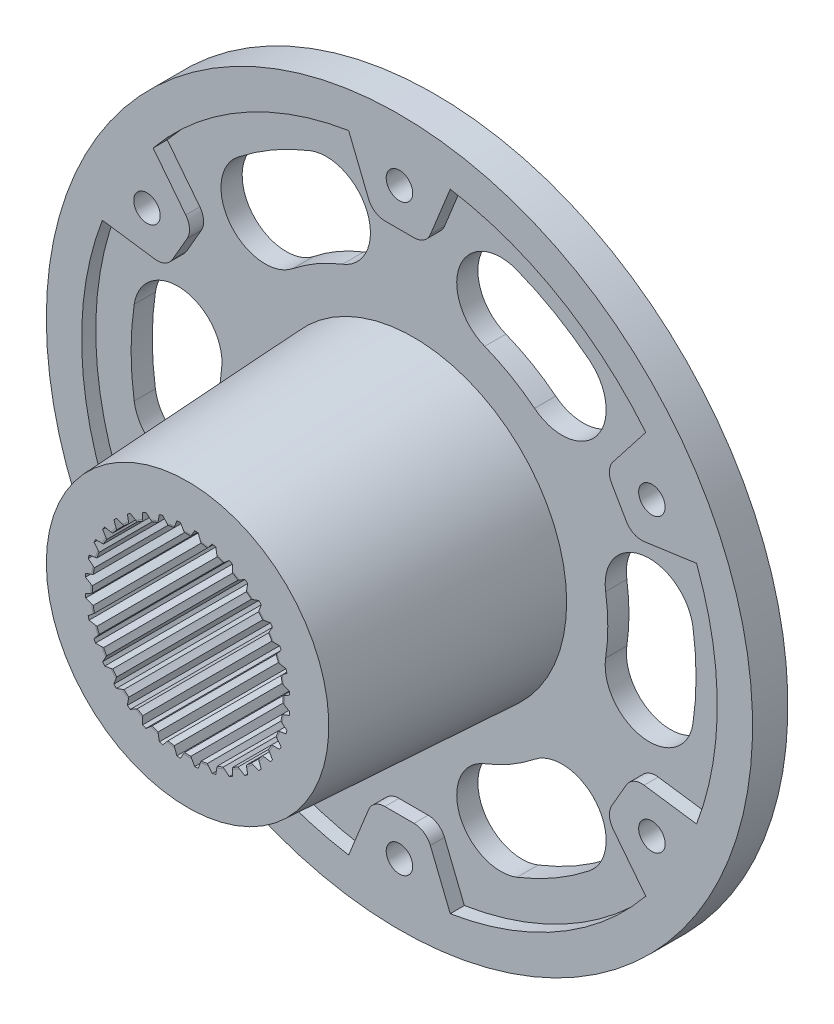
from build123d import *

# Parameters (mm, degrees)
BOSS_EXTRUDE1_REACH = 213.774
BOSS_EXTRUDE1_START = -70
SKETCH2_R           = 40
BOSS_EXTRUDE1_DRAFT = -3
BOSS_EXTRUDE3_REACH = 155.623
SKETCH5_R           = 3.75
CUT_EXTRUDE1_DEPTH  = 154.622914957
CIRPATTERN2_COUNT   = 6
CUT_EXTRUDE2_DEPTH  = 156.228863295
CIRPATTERN3_COUNT   = 6
SKETCH3_R           = 25.5
CUT_EXTRUDE11_DEPTH = 165.715659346
CUT_EXTRUDE11_DRAFT = -3
FILLET2_R           = 2
SKETCH41_R          = 27
CUT_EXTRUDE21_DEPTH = 158.797338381
CUT_EXTRUDE3_DEPTH  = 158.797338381
CIRPATTERN1_COUNT   = 36


with BuildPart() as part:
    # Sketch1 → Revolve1 (revolve)
    with BuildSketch(Plane(origin=(0, 0, 0), x_dir=(0, 0, -1), z_dir=(1, 0, 0)), mode=Mode.PRIVATE) as revolve1_sk:
        Polygon((0, 0), (0, 100), (-10, 100), (-10, 90), (-6, 90), (-6, 0), align=None)
    revolve(revolve1_sk.sketch.rotate(Axis((0, 0, 0), (0, 0, 1)), 90), axis=Axis((0, 0, 0), (0, 0, 1)))




with BuildPart() as boss_extrude1_long_prism_1:
    # Sketch2 → Boss-Extrude1 (the long prism of profile 1, to be tilted and cut off)
    with BuildSketch(Plane(origin=(0, 0, 0), x_dir=(-1, 0, 0), z_dir=(0, 0, -1)).offset(BOSS_EXTRUDE1_START)):
        Circle(SKETCH2_R)
    extrude(amount=BOSS_EXTRUDE1_REACH)
    boss_extrude1_tool1_sides = [boss_extrude1_long_prism_1.faces().sort_by_distance(p)[0] for p in [
        (40, 0, -36.887),
    ]]
    draft(boss_extrude1_tool1_sides, Plane(origin=(0, 0, 0), x_dir=(-1, 0, 0), z_dir=(0, 0, -1)).offset(BOSS_EXTRUDE1_START), BOSS_EXTRUDE1_DRAFT)  # the draft: side faces tilted about the start plane


with BuildPart() as part_1:
    add(part.part)
    boss_extrude1_tool1 = boss_extrude1_long_prism_1.part - part.part
    add(boss_extrude1_tool1.solids().sort_by_distance((0, 0, 70))[0])

    # Sketch4 → Boss-Extrude3 (add, up to next)
    with BuildSketch(Plane.XY.offset(10), mode=Mode.PRIVATE) as boss_extrude3_sk1:
        with BuildLine():
            Line((-14.38247559, 88.843370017), (-8.763376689, 74.935612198))
            ThreePointArc((-8.763376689, 74.935612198), (-6.923421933, 72.663457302), (-4.127457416, 71.808645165))
            Line((-4.127457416, 71.808645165), (4.127457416, 71.808645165))
            ThreePointArc((4.127457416, 71.808645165), (6.923421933, 72.663457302), (8.763376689, 74.935612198))
            Line((8.763376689, 74.935612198), (14.38247559, 88.843370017))
            ThreePointArc((14.38247559, 88.843370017), (0, 90), (-14.38247559, 88.843370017))
        make_face()
    boss_extrude3_tool1 = extrude(boss_extrude3_sk1.sketch, amount=-BOSS_EXTRUDE3_REACH, mode=Mode.PRIVATE) - part_1.part
    boss_extrude3 = boss_extrude3_tool1.solids().sort_by_distance((0, 81.769137, 10))[0]
    add(boss_extrude3)

    # Sketch5 → Cut-Extrude1 (cut, through all)
    with BuildSketch(Plane.XY.offset(10)):
        with Locations((0, 82.55)):
            Circle(SKETCH5_R)
    cut_extrude1 = extrude(amount=-CUT_EXTRUDE1_DEPTH, mode=Mode.SUBTRACT)

    # CirPattern2: Boss-Extrude3, Cut-Extrude1 ×6 about axis
    cirpattern2_axis = Axis((0, 0, 0), (0, 0, 1))
    add([boss_extrude3.rotate(cirpattern2_axis, i * 360 / CIRPATTERN2_COUNT) for i in range(1, CIRPATTERN2_COUNT)])
    add([cut_extrude1.rotate(cirpattern2_axis, i * 360 / CIRPATTERN2_COUNT) for i in range(1, CIRPATTERN2_COUNT)], mode=Mode.SUBTRACT)

    # Sketch6 → Cut-Extrude2 (cut, through all)
    with BuildSketch(Plane.XY.offset(6)):
        with BuildLine():
            ThreePointArc((34.253045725, 43.031719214), (51.81776503, 45.02687228), (49.822611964, 62.591591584))
            ThreePointArc((49.822611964, 62.591591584), (40, 69.282032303), (29.294602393, 74.443443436))
            ThreePointArc((29.294602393, 74.443443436), (13.085532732, 67.388937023), (20.140039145, 51.179867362))
            ThreePointArc((20.140039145, 51.179867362), (27.5, 47.631397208), (34.253045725, 43.031719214))
        make_face()
    cut_extrude2 = extrude(amount=-CUT_EXTRUDE2_DEPTH, mode=Mode.SUBTRACT)

    # CirPattern3: Cut-Extrude2 ×6 about axis
    cirpattern3_axis = Axis((0, 0, 0), (0, 0, 1))
    for i in range(1, CIRPATTERN3_COUNT):
        add(cut_extrude2.rotate(cirpattern3_axis, i * 360 / CIRPATTERN3_COUNT), mode=Mode.SUBTRACT)


with BuildPart() as cut_extrude11_tool:
    # Sketch3 → Cut-Extrude11 (with draft: the straight prism first)
    with BuildSketch(Plane(origin=(-8.011605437, -2.78492849, 70), x_dir=(1, 0, 0), z_dir=(0, 0, 1))):
        with Locations((8.011605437, 2.78492849)):
            Circle(SKETCH3_R)
    extrude(amount=-CUT_EXTRUDE11_DEPTH)
    # Cut-Extrude11: the draft: its side faces are tilted about the plane it starts from
    cut_extrude11_sides = [cut_extrude11_tool.faces().sort_by_distance(p)[0] for p in [
        (-25.5, 0, -12.857829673),
    ]]
    draft(cut_extrude11_sides, Plane(origin=(-8.011605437, -2.78492849, 70), x_dir=(1, 0, 0), z_dir=(0, 0, 1)), CUT_EXTRUDE11_DRAFT)


with BuildPart() as part_2:
    add(part_1.part)

    # Cut-Extrude11: cut by cut_extrude11_tool
    add(cut_extrude11_tool.part, mode=Mode.SUBTRACT)

    # Fillet2
    fillet2_edges = [part_2.edges().sort_by_distance(p)[0] for p in [
        (-25.5, 0, 70),
    ]]
    fillet(fillet2_edges, radius=FILLET2_R)

    # Sketch41 → Cut-Extrude21 (cut, through all)
    with BuildSketch(Plane.XY.offset(70)):
        Circle(SKETCH41_R)
    extrude(amount=-CUT_EXTRUDE21_DEPTH, mode=Mode.SUBTRACT)

    # Sketch51 → Cut-Extrude3 (cut, through all)
    with BuildSketch(Plane.XY.offset(70)):
        with BuildLine():
            Line((26.984775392, 0.906585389), (28.928929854, 2.029043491))
            ThreePointArc((28.928929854, 2.029043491), (28.889646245, 2.52751654), (28.841774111, 3.02523819))
            Line((28.841774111, 3.02523819), (26.73224292, 3.793044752))
            ThreePointArc((26.73224292, 3.793044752), (26.897256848, 2.353205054), (26.984775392, 0.906585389))
        make_face()
    cut_extrude3 = extrude(amount=-CUT_EXTRUDE3_DEPTH, mode=Mode.SUBTRACT)

    # CirPattern1: Cut-Extrude3 ×36 about axis
    cirpattern1_axis = Axis((0, 0, 0), (0, 0, 1))
    for i in range(1, CIRPATTERN1_COUNT):
        add(cut_extrude3.rotate(cirpattern1_axis, i * 360 / CIRPATTERN1_COUNT), mode=Mode.SUBTRACT)


solid = part_2.part
